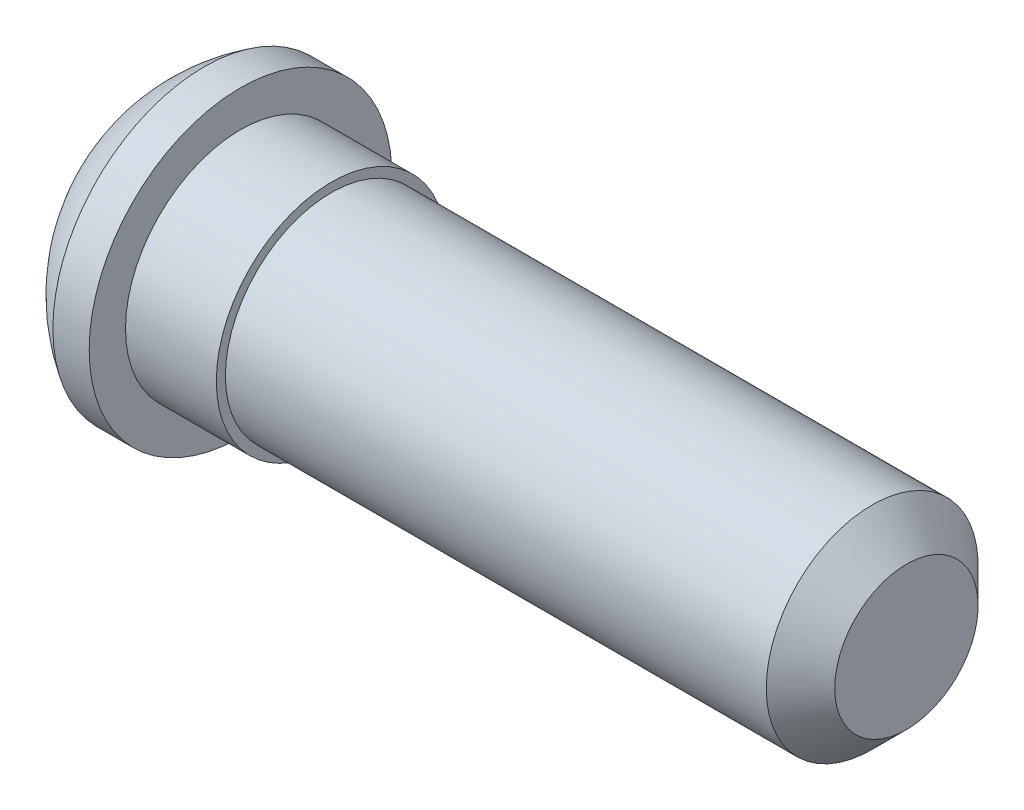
from build123d import *


with BuildPart() as part:
    # Sketch1 → Revolve1 (revolve)
    with BuildSketch(Plane.XY, mode=Mode.PRIVATE) as revolve1_sk:
        with BuildLine():
            Line((4.445, 7.9375), (6.35, 7.9375))
            Line((6.35, 7.9375), (6.35, 6.0325))
            Line((6.35, 6.0325), (11.1125, 6.0325))
            Line((11.1125, 6.0325), (11.1125, 5.55625))
            Line((11.1125, 5.55625), (39.478948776, 5.55625))
            Line((39.478948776, 5.55625), (41.275, 3.760198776))
            Line((41.275, 3.760198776), (41.275, 0))
            Line((41.275, 0), (0, 0))
            ThreePointArc((0, 0), (1.186912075, 4.548679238), (4.445, 7.9375))
        make_face()
    revolve(revolve1_sk.sketch.rotate(Axis((-46.862328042, 0, 0), (1, 0, 0)), 90), axis=Axis((-46.862328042, 0, 0), (1, 0, 0)))


solid = part.part
